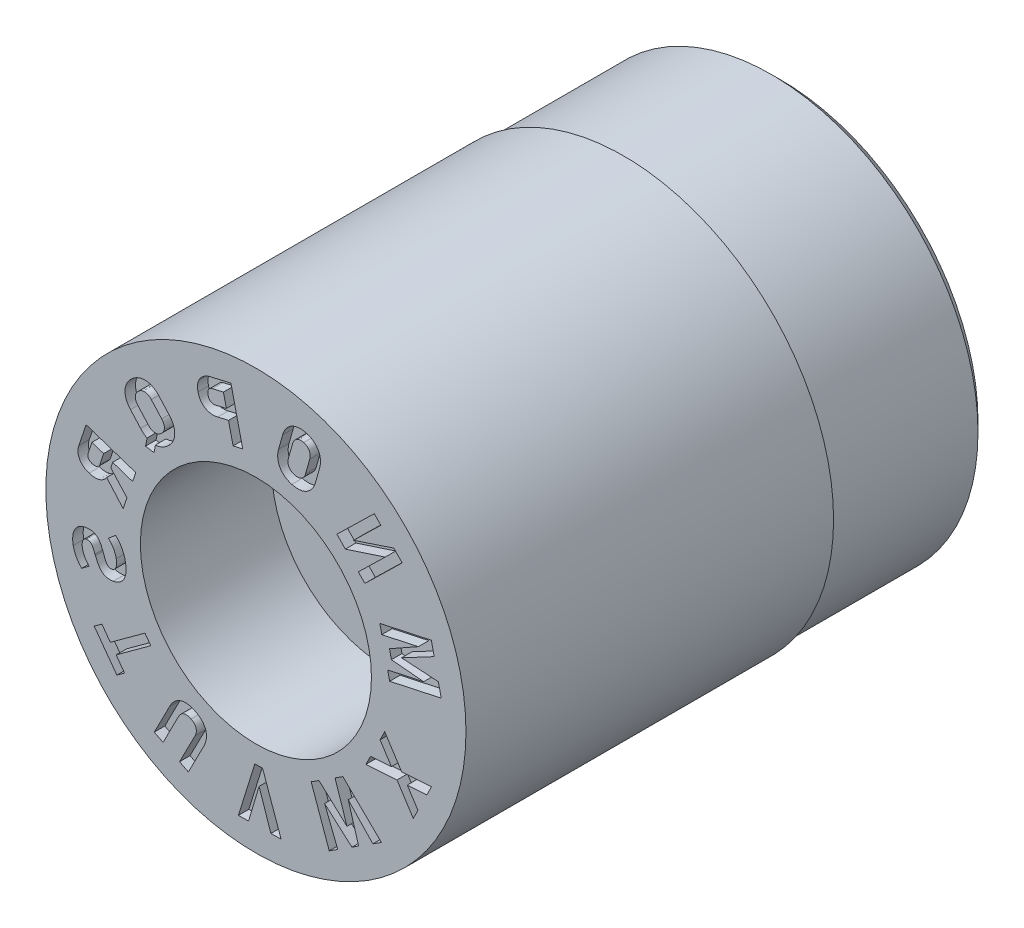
from build123d import *

# Parameters (mm, degrees)
SKETCH4_W          = 3
SKETCH4_H          = 1
CUT_EXTRUDE1_DEPTH = 0.2


with BuildPart() as part:
    # Sketch1 → Revolve1 (revolve)
    with BuildSketch(Plane(origin=(0, 0, 0), x_dir=(0, 0, -1), z_dir=(1, 0, 0)), mode=Mode.PRIVATE) as revolve1_sk:
        Polygon((0, 4), (0, 2.2), (2.5, 2.2), (2.5, 1.15), (10, 1.15), (10, 3.75), (9.75, 4), align=None)
    revolve(revolve1_sk.sketch.rotate(Axis((0, 0, 3.797909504), (0, 0, -1)), 90), axis=Axis((0, 0, 3.797909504), (0, 0, -1)))

    # Sketch4 → Cut-Revolve1 (revolve, cut)
    with BuildSketch(Plane(origin=(0, 0, 0), x_dir=(0, 0, -1), z_dir=(1, 0, 0)), mode=Mode.PRIVATE) as cut_revolve1_sk:
        with Locations((8.5, 4.435)):
            Rectangle(SKETCH4_W, SKETCH4_H)
    revolve(cut_revolve1_sk.sketch.rotate(Axis((0, 0, 0), (0, 0, -1)), 90), axis=Axis((0, 0, 0), (0, 0, -1)), mode=Mode.SUBTRACT)

    # Sketch6 → Cut-Extrude1 (cut)
    # profile 1 of 12: a face of its own
    with BuildSketch(Plane.XY):
        Polygon((3.394229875, 0.938010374), (3.341406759, 1.1816908), (2.359988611, 0.969374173), (2.396420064, 0.801280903), (3.094007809, 0.952272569), (2.544983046, 0.644005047), (2.580321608, 0.48078676), (3.194151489, 0.424211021), (2.510034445, 0.276135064), (2.546465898, 0.108041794), (3.527884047, 0.320358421), (3.475060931, 0.564038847), (2.773085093, 0.607854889), align=None)
    # profile 2 of 12: a face of its own
    with BuildSketch(Plane.XY):
        Polygon((2.786258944, 2.179442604), (2.626298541, 2.343514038), (1.858096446, 2.088459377), (2.379411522, 2.596736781), (2.254183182, 2.725230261), (1.542436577, 2.031205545), (1.703388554, 1.866088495), (2.463328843, 2.114715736), (1.949482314, 1.613702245), (2.07451234, 1.485417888), align=None)
    # profile 3 of 12: a face of its own
    with BuildSketch(Plane.XY):
        with BuildLine():
            Line((1.135151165, 2.680125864), (1.212216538, 2.95287737))
            add(Edge.make_bspline(
                [(1.212216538, 2.95287737), (1.217012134, 2.970045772), (1.222619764, 2.995856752), (1.22781073, 3.030308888), (1.229422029, 3.055403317), (1.229959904, 3.080065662), (1.228409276, 3.104301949), (1.225754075, 3.128191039), (1.221249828, 3.151530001), (1.215414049, 3.174298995), (1.207806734, 3.196273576), (1.199030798, 3.217612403), (1.188651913, 3.23800887), (1.176695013, 3.257502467), (1.163680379, 3.276358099), (1.148891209, 3.294187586), (1.132773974, 3.311167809), (1.115509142, 3.327364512), (1.09668295, 3.342074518), (1.076941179, 3.355823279), (1.056142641, 3.368666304), (1.034010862, 3.379975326), (1.002471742, 3.393629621), (0.977876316, 3.402304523), (0.960887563, 3.406983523)],
                knots=[0, 0, 0, 0, 0.091422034, 0.135457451, 0.178647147, 0.22037857, 0.261961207, 0.3031769, 0.343651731, 0.383838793, 0.423697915, 0.462886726, 0.502168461, 0.540991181, 0.58017534, 0.619643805, 0.659727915, 0.700270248, 0.741002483, 0.782210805, 0.823695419, 0.866341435, 0.909628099, 1, 1, 1, 1], degree=3))
            add(Edge.make_bspline(
                [(0.960887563, 3.406983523), (0.94387801, 3.411575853), (0.918449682, 3.417960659), (0.884319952, 3.422097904), (0.859514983, 3.42425249), (0.835085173, 3.424306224), (0.811000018, 3.423080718), (0.787315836, 3.419983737), (0.764032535, 3.415497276), (0.741436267, 3.40921077), (0.719472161, 3.401815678), (0.698471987, 3.392664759), (0.6781024, 3.382306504), (0.658593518, 3.370384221), (0.640059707, 3.356696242), (0.622033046, 3.341967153), (0.605167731, 3.325473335), (0.589057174, 3.307907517), (0.574285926, 3.288987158), (0.560272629, 3.269164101), (0.547921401, 3.247830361), (0.53630394, 3.225493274), (0.522360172, 3.193596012), (0.513937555, 3.168521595), (0.509155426, 3.151334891)],
                knots=[0, 0, 0, 0, 0.090478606, 0.133987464, 0.17621087, 0.218093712, 0.259164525, 0.299807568, 0.340490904, 0.380663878, 0.420006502, 0.459250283, 0.498027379, 0.537134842, 0.576341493, 0.616113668, 0.656419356, 0.69720995, 0.73826155, 0.779443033, 0.821603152, 0.864568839, 0.908517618, 1, 1, 1, 1], degree=3))
            Line((0.509155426, 3.151334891), (0.432090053, 2.878583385))
            add(Edge.make_bspline(
                [(0.432090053, 2.878583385), (0.427165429, 2.861481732), (0.421312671, 2.835686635), (0.416615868, 2.801258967), (0.414719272, 2.776157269), (0.414440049, 2.751527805), (0.415669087, 2.727226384), (0.418352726, 2.703322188), (0.423080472, 2.679980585), (0.428918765, 2.657227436), (0.436294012, 2.635168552), (0.445222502, 2.613979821), (0.455730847, 2.593675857), (0.467282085, 2.574030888), (0.480734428, 2.555370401), (0.495301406, 2.537293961), (0.511548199, 2.52030571), (0.528790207, 2.50408766), (0.54763701, 2.48940789), (0.56731878, 2.475558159), (0.588337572, 2.463096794), (0.610319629, 2.451380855), (0.641959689, 2.437765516), (0.66662495, 2.429123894), (0.683592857, 2.424370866)],
                knots=[0, 0, 0, 0, 0.091281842, 0.135438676, 0.17814157, 0.220333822, 0.2617021, 0.302901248, 0.343594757, 0.383765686, 0.423341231, 0.462796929, 0.50158372, 0.540551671, 0.579581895, 0.619478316, 0.659546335, 0.700072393, 0.740788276, 0.781980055, 0.82344948, 0.866054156, 0.909668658, 1, 1, 1, 1], degree=3))
            add(Edge.make_bspline(
                [(0.683592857, 2.424370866), (0.700556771, 2.419837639), (0.725924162, 2.413548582), (0.760012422, 2.409274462), (0.784837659, 2.407514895), (0.809254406, 2.407075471), (0.83330662, 2.408402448), (0.856992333, 2.411466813), (0.880267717, 2.415981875), (0.902944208, 2.422201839), (0.924795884, 2.429887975), (0.945970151, 2.438692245), (0.966077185, 2.449509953), (0.985630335, 2.461411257), (1.004343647, 2.474772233), (1.022085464, 2.489771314), (1.039194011, 2.505905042), (1.055211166, 2.523585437), (1.070104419, 2.542411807), (1.083719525, 2.562495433), (1.096532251, 2.583552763), (1.10775069, 2.606112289), (1.1217496, 2.63795565), (1.130529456, 2.66289815), (1.135151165, 2.680125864)],
                knots=[0, 0, 0, 0, 0.09019369, 0.133725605, 0.176130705, 0.217857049, 0.258949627, 0.299614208, 0.340319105, 0.380513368, 0.420146, 0.459126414, 0.498042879, 0.537171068, 0.576532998, 0.615884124, 0.656299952, 0.697112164, 0.738185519, 0.779369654, 0.821547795, 0.864563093, 0.908535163, 1, 1, 1, 1], degree=3))
        make_face()
        with BuildLine():
            Line((0.618786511, 2.820966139), (0.69837861, 3.102922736))
            add(Edge.make_bspline(
                [(0.69837861, 3.102922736), (0.70295274, 3.118755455), (0.71184631, 3.141470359), (0.72859073, 3.168595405), (0.743188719, 3.186083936), (0.759458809, 3.201171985), (0.77745389, 3.213427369), (0.796740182, 3.223153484), (0.817667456, 3.229464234), (0.839569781, 3.233362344), (0.870726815, 3.234236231), (0.89421834, 3.23011317), (0.909678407, 3.225683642)],
                knots=[0, 0, 0, 0, 0.179643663, 0.264038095, 0.346325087, 0.42716418, 0.505033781, 0.582875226, 0.661567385, 0.742348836, 0.824682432, 1, 1, 1, 1], degree=3))
            add(Edge.make_bspline(
                [(0.909678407, 3.225683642), (0.925284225, 3.221654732), (0.94719174, 3.212450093), (0.973452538, 3.195775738), (0.989979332, 3.180861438), (1.004478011, 3.16456088), (1.016047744, 3.146269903), (1.024879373, 3.126371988), (1.030778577, 3.105005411), (1.034243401, 3.08252397), (1.034120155, 3.050661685), (1.029980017, 3.026643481), (1.025452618, 3.010774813)],
                knots=[0, 0, 0, 0, 0.17523863, 0.257490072, 0.337988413, 0.417174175, 0.494693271, 0.572976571, 0.653699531, 0.735737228, 0.82022307, 1, 1, 1, 1], degree=3))
            Line((1.025452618, 3.010774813), (0.945860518, 2.728818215))
            add(Edge.make_bspline(
                [(0.945860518, 2.728818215), (0.941522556, 2.712890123), (0.932534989, 2.690117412), (0.915754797, 2.662923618), (0.901176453, 2.645408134), (0.884887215, 2.630442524), (0.866966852, 2.61818799), (0.847608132, 2.60851884), (0.826756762, 2.601927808), (0.804729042, 2.598286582), (0.773640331, 2.597596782), (0.75012233, 2.601408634), (0.734734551, 2.605950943)],
                knots=[0, 0, 0, 0, 0.179767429, 0.264883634, 0.347152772, 0.427262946, 0.50511565, 0.582940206, 0.662173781, 0.742451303, 0.825386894, 1, 1, 1, 1], degree=3))
            add(Edge.make_bspline(
                [(0.734734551, 2.605950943), (0.719181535, 2.610074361), (0.69716732, 2.619121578), (0.671035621, 2.635923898), (0.654200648, 2.65051958), (0.640016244, 2.667117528), (0.628330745, 2.685344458), (0.619621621, 2.705240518), (0.613389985, 2.72652776), (0.610292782, 2.74910651), (0.609900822, 2.781033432), (0.614372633, 2.805102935), (0.618786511, 2.820966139)],
                knots=[0, 0, 0, 0, 0.175128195, 0.257334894, 0.337663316, 0.417030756, 0.494507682, 0.572748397, 0.652926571, 0.735489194, 0.820320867, 1, 1, 1, 1], degree=3))
        make_face(mode=Mode.SUBTRACT)
    # profile 4 of 12: a face of its own
    with BuildSketch(Plane.XY):
        with BuildLine():
            Line((-0.521556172, 2.876014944), (-0.434541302, 2.49881903))
            Line((-0.434541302, 2.49881903), (-0.251282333, 2.540985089))
            Line((-0.251282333, 2.540985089), (-0.475581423, 3.513286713))
            Line((-0.475581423, 3.513286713), (-0.865487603, 3.423449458))
            add(Edge.make_bspline(
                [(-0.865487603, 3.423449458), (-0.894282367, 3.417099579), (-0.935427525, 3.40285547), (-0.984978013, 3.374907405), (-1.01721997, 3.350257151), (-1.045539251, 3.322341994), (-1.068843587, 3.290978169), (-1.087678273, 3.256900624), (-1.101088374, 3.219950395), (-1.109968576, 3.180912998), (-1.113998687, 3.125224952), (-1.108998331, 3.082829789), (-1.102272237, 3.05480594)],
                knots=[0, 0, 0, 0, 0.179264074, 0.262914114, 0.345094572, 0.425466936, 0.504017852, 0.581987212, 0.661488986, 0.742357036, 0.824785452, 1, 1, 1, 1], degree=3))
            add(Edge.make_bspline(
                [(-1.102272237, 3.05480594), (-1.095722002, 3.026757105), (-1.082085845, 2.986270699), (-1.053775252, 2.93815959), (-1.028785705, 2.907054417), (-1.000440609, 2.879961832), (-0.96869942, 2.857678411), (-0.933974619, 2.840071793), (-0.896559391, 2.827148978), (-0.856803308, 2.819560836), (-0.80011989, 2.816036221), (-0.75690198, 2.821618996), (-0.728237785, 2.828356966)],
                knots=[0, 0, 0, 0, 0.175740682, 0.257985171, 0.339043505, 0.41817568, 0.496190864, 0.574525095, 0.654741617, 0.73663625, 0.820445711, 1, 1, 1, 1], degree=3))
            Line((-0.728237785, 2.828356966), (-0.521556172, 2.876014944))
        make_face()
        with BuildLine():
            Line((-0.562266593, 3.052488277), (-0.773582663, 3.003718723))
            add(Edge.make_bspline(
                [(-0.773582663, 3.003718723), (-0.783961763, 3.001503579), (-0.799700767, 2.999431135), (-0.820400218, 3.001313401), (-0.834980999, 3.005053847), (-0.848900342, 3.010466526), (-0.86165837, 3.018251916), (-0.873608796, 3.027503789), (-0.884233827, 3.038771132), (-0.893697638, 3.051592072), (-0.904342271, 3.071228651), (-0.910045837, 3.087313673), (-0.912343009, 3.098636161)],
                knots=[0, 0, 0, 0, 0.168779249, 0.249596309, 0.32843233, 0.407061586, 0.485720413, 0.564814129, 0.646318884, 0.730711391, 0.817085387, 1, 1, 1, 1], degree=3))
            add(Edge.make_bspline(
                [(-0.912343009, 3.098636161), (-0.914930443, 3.110035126), (-0.917403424, 3.127095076), (-0.916463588, 3.149605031), (-0.91373769, 3.165364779), (-0.909305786, 3.180288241), (-0.902862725, 3.194038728), (-0.894635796, 3.20646921), (-0.884599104, 3.217465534), (-0.873178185, 3.227275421), (-0.855146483, 3.238029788), (-0.840058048, 3.243525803), (-0.829462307, 3.245812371)],
                knots=[0, 0, 0, 0, 0.184525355, 0.269846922, 0.354276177, 0.436138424, 0.514600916, 0.592865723, 0.67024582, 0.748708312, 0.829398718, 1, 1, 1, 1], degree=3))
            Line((-0.829462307, 3.245812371), (-0.618116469, 3.294588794))
            Line((-0.618116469, 3.294588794), (-0.562266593, 3.052488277))
        make_face(mode=Mode.SUBTRACT)
    # profile 5 of 12: a face of its own
    with BuildSketch(Plane.XY):
        with BuildLine():
            Line((-2.071986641, 1.810539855), (-2.100720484, 1.661978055))
            Line((-2.100720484, 1.661978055), (-1.939665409, 1.633273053))
            Line((-1.939665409, 1.633273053), (-1.912358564, 1.775217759))
            add(Edge.make_bspline(
                [(-1.912358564, 1.775217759), (-1.907225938, 1.775416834), (-1.894364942, 1.776224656), (-1.873699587, 1.778650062), (-1.850567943, 1.783350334), (-1.827508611, 1.789313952), (-1.804810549, 1.797148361), (-1.782510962, 1.806598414), (-1.760404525, 1.81743036), (-1.739050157, 1.830441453), (-1.710039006, 1.849259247), (-1.689959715, 1.866266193), (-1.67657857, 1.877858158)],
                knots=[0.553679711, 0.553679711, 0.553679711, 0.553679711, 0.579878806, 0.619385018, 0.659716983, 0.70019606, 0.740809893, 0.782074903, 0.823696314, 0.866250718, 0.90955479, 1, 1, 1, 1], degree=3))
            add(Edge.make_bspline(
                [(-1.67657857, 1.877858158), (-1.663326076, 1.889588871), (-1.644720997, 1.90818777), (-1.622400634, 1.934622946), (-1.607615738, 1.954906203), (-1.594244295, 1.975505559), (-1.58234498, 1.996687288), (-1.572207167, 2.018477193), (-1.563546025, 2.040732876), (-1.556589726, 2.063263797), (-1.551115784, 2.085868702), (-1.547604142, 2.108656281), (-1.545754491, 2.131526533), (-1.545140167, 2.154503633), (-1.546524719, 2.177560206), (-1.549849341, 2.200668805), (-1.554323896, 2.223898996), (-1.560650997, 2.246987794), (-1.568548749, 2.269813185), (-1.578255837, 2.292291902), (-1.589534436, 2.314405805), (-1.602385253, 2.336231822), (-1.621855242, 2.365281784), (-1.63880819, 2.385786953), (-1.650610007, 2.399260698)],
                knots=[0, 0, 0, 0, 0.090247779, 0.133974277, 0.176350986, 0.218190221, 0.259184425, 0.300165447, 0.340676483, 0.380906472, 0.42036049, 0.459207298, 0.498375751, 0.537338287, 0.576359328, 0.616025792, 0.656354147, 0.696955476, 0.738027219, 0.779458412, 0.821744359, 0.864571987, 0.908583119, 1, 1, 1, 1], degree=3))
            Line((-1.650610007, 2.399260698), (-1.840940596, 2.611640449))
            add(Edge.make_bspline(
                [(-1.840940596, 2.611640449), (-1.852707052, 2.625214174), (-1.871795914, 2.643697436), (-1.898257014, 2.666562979), (-1.918716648, 2.681490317), (-1.939482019, 2.695104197), (-1.960799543, 2.707172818), (-1.982609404, 2.717565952), (-2.004845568, 2.726424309), (-2.027353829, 2.733581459), (-2.049999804, 2.739283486), (-2.072836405, 2.742970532), (-2.095754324, 2.745121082), (-2.118725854, 2.745616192), (-2.141732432, 2.744417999), (-2.164821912, 2.741714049), (-2.187915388, 2.7370011), (-2.210857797, 2.730759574), (-2.233595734, 2.722987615), (-2.255909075, 2.71354897), (-2.277954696, 2.702591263), (-2.299645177, 2.690030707), (-2.328414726, 2.67072812), (-2.348711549, 2.653980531), (-2.362029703, 2.642290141)],
                knots=[0, 0, 0, 0, 0.091500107, 0.135420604, 0.17827148, 0.220576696, 0.262026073, 0.303120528, 0.343722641, 0.384020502, 0.423519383, 0.462729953, 0.501891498, 0.540854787, 0.579819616, 0.619323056, 0.659321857, 0.69992397, 0.740534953, 0.781797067, 0.823415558, 0.86603746, 0.909561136, 1, 1, 1, 1], degree=3))
            add(Edge.make_bspline(
                [(-2.362029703, 2.642290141), (-2.374943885, 2.630237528), (-2.394074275, 2.612166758), (-2.415950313, 2.585365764), (-2.43096626, 2.565346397), (-2.444447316, 2.544761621), (-2.45615494, 2.523548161), (-2.466433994, 2.501828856), (-2.475026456, 2.47961312), (-2.48201747, 2.457091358), (-2.487400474, 2.434466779), (-2.491239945, 2.411731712), (-2.493082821, 2.388839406), (-2.49340028, 2.365849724), (-2.491993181, 2.34282), (-2.489069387, 2.319644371), (-2.484178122, 2.296488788), (-2.477959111, 2.273358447), (-2.470030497, 2.250538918), (-2.460331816, 2.228058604), (-2.449050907, 2.20594514), (-2.436200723, 2.184119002), (-2.4167305, 2.155069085), (-2.399777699, 2.134563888), (-2.387975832, 2.121090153)],
                knots=[0, 0, 0, 0, 0.090258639, 0.133806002, 0.176368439, 0.217909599, 0.259234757, 0.299899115, 0.340421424, 0.380662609, 0.420127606, 0.459002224, 0.498181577, 0.537187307, 0.576219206, 0.61581336, 0.656258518, 0.696871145, 0.737954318, 0.77939704, 0.821694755, 0.8645343, 0.90855768, 1, 1, 1, 1], degree=3))
            Line((-2.387975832, 2.121090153), (-2.197645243, 1.908710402))
            add(Edge.make_bspline(
                [(-2.197645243, 1.908710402), (-2.185860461, 1.895162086), (-2.166825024, 1.876604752), (-2.140252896, 1.853834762), (-2.120019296, 1.83858704), (-2.099032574, 1.825298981), (-2.08297394, 1.816119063), (-2.073864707, 1.811475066), (-2.071986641, 1.810539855)],
                knots=[0, 0, 0, 0, 0.091506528, 0.135430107, 0.17845877, 0.220611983, 0.262064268, 0.272765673, 0.272765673, 0.272765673, 0.272765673], degree=3))
        make_face()
        with BuildLine():
            Line((-2.047987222, 2.036275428), (-2.24471167, 2.255719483))
            add(Edge.make_bspline(
                [(-2.24471167, 2.255719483), (-2.255887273, 2.268032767), (-2.270325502, 2.287899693), (-2.284502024, 2.316693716), (-2.291497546, 2.338429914), (-2.295502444, 2.360314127), (-2.296472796, 2.382159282), (-2.29404297, 2.403878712), (-2.288329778, 2.425183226), (-2.279702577, 2.445855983), (-2.263567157, 2.472600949), (-2.247688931, 2.490446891), (-2.235570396, 2.50116109)],
                knots=[0, 0, 0, 0, 0.180084, 0.264435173, 0.34680363, 0.426690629, 0.504877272, 0.582907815, 0.66255024, 0.743142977, 0.824840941, 1, 1, 1, 1], degree=3))
            add(Edge.make_bspline(
                [(-2.235570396, 2.50116109), (-2.223506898, 2.511841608), (-2.204248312, 2.526122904), (-2.175739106, 2.538982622), (-2.154309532, 2.545566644), (-2.132511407, 2.548631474), (-2.110685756, 2.548813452), (-2.089015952, 2.545489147), (-2.067659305, 2.53917415), (-2.046799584, 2.529943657), (-2.01988148, 2.512529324), (-2.001312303, 2.496504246), (-1.990418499, 2.483850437)],
                knots=[0, 0, 0, 0, 0.174919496, 0.257091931, 0.337884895, 0.416966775, 0.494750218, 0.573557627, 0.653541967, 0.735473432, 0.819741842, 1, 1, 1, 1], degree=3))
            Line((-1.990418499, 2.483850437), (-1.793694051, 2.264406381))
            add(Edge.make_bspline(
                [(-1.793694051, 2.264406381), (-1.782405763, 2.252214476), (-1.768320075, 2.232174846), (-1.754096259, 2.203460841), (-1.747113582, 2.181716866), (-1.74310405, 2.159834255), (-1.742139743, 2.137990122), (-1.744542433, 2.116332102), (-1.750296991, 2.095111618), (-1.758889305, 2.074394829), (-1.775276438, 2.047693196), (-1.791072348, 2.029694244), (-1.803240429, 2.019009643)],
                knots=[0, 0, 0, 0, 0.179661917, 0.264031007, 0.346416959, 0.426320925, 0.504524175, 0.582571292, 0.661502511, 0.742112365, 0.824803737, 1, 1, 1, 1], degree=3))
            add(Edge.make_bspline(
                [(-1.803240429, 2.019009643), (-1.815274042, 2.008248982), (-1.834570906, 1.994232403), (-1.862861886, 1.981036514), (-1.884353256, 1.974921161), (-1.906062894, 1.971430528), (-1.927859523, 1.97135328), (-1.949453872, 1.974647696), (-1.970809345, 1.980978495), (-1.991694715, 1.990201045), (-2.018887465, 2.007235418), (-2.037056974, 2.023737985), (-2.047987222, 2.036275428)],
                knots=[0, 0, 0, 0, 0.175140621, 0.256784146, 0.337393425, 0.416763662, 0.494645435, 0.572816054, 0.652901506, 0.735638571, 0.819694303, 1, 1, 1, 1], degree=3))
        make_face(mode=Mode.SUBTRACT)
    # profile 6 of 12: a face of its own
    with BuildSketch(Plane.XY):
        with BuildLine():
            Line((-2.727747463, 1.082066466), (-2.347620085, 0.954385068))
            Line((-2.347620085, 0.954385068), (-2.287716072, 1.132229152))
            Line((-2.287716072, 1.132229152), (-3.233089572, 1.449771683))
            Line((-3.233089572, 1.449771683), (-3.372112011, 1.036020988))
            add(Edge.make_bspline(
                [(-3.372112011, 1.036020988), (-3.380594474, 1.011415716), (-3.38851292, 0.973635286), (-3.389249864, 0.92312386), (-3.384029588, 0.88707868), (-3.374062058, 0.852562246), (-3.359348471, 0.819817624), (-3.339479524, 0.789509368), (-3.315250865, 0.76136871), (-3.286644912, 0.735941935), (-3.242020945, 0.70529004), (-3.203802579, 0.688881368), (-3.177225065, 0.679835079)],
                knots=[0, 0, 0, 0, 0.170636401, 0.251235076, 0.330355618, 0.408725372, 0.48632043, 0.565006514, 0.645708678, 0.729338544, 0.815468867, 1, 1, 1, 1], degree=3))
            add(Edge.make_bspline(
                [(-3.177225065, 0.679835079), (-3.15063298, 0.670802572), (-3.110283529, 0.661238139), (-3.056309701, 0.658744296), (-3.018162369, 0.661767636), (-2.981772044, 0.669423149), (-2.947658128, 0.681873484), (-2.916147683, 0.69902197), (-2.887213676, 0.720461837), (-2.862169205, 0.745813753), (-2.847716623, 0.764534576), (-2.841354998, 0.774125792)],
                knots=[0, 0, 0, 0, 0.184576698, 0.270218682, 0.353956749, 0.435258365, 0.51372416, 0.591599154, 0.670106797, 0.749358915, 0.824936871, 0.824936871, 0.824936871, 0.824936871], degree=3))
            Line((-2.841354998, 0.774125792), (-2.527919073, 0.417717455))
            Line((-2.527919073, 0.417717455), (-2.455468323, 0.633360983))
            Line((-2.455468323, 0.633360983), (-2.764024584, 0.973957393))
            Line((-2.764024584, 0.973957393), (-2.727747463, 1.082066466))
        make_face()
        with BuildLine():
            Line((-2.899191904, 1.139653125), (-2.973617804, 0.918027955))
            add(Edge.make_bspline(
                [(-2.973617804, 0.918027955), (-2.976433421, 0.909309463), (-2.982308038, 0.897027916), (-2.993525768, 0.883110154), (-3.003267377, 0.874388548), (-3.014179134, 0.867113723), (-3.02613619, 0.861172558), (-3.039317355, 0.857499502), (-3.053405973, 0.855332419), (-3.068204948, 0.85450718), (-3.089264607, 0.856256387), (-3.105119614, 0.859460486), (-3.115581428, 0.863009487)],
                knots=[0, 0, 0, 0, 0.161067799, 0.236329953, 0.312906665, 0.389938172, 0.466300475, 0.546541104, 0.629300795, 0.716596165, 0.806347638, 1, 1, 1, 1], degree=3))
            add(Edge.make_bspline(
                [(-3.115581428, 0.863009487), (-3.125957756, 0.866695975), (-3.141129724, 0.872686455), (-3.158745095, 0.884432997), (-3.170238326, 0.893825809), (-3.180121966, 0.904124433), (-3.188364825, 0.91508677), (-3.194337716, 0.927051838), (-3.198725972, 0.939446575), (-3.201096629, 0.952377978), (-3.20149903, 0.970436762), (-3.198856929, 0.984010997), (-3.195689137, 0.992794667)],
                knots=[0, 0, 0, 0, 0.193238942, 0.282530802, 0.369322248, 0.452323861, 0.531630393, 0.608138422, 0.685234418, 0.760907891, 0.836971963, 1, 1, 1, 1], degree=3))
            Line((-3.195689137, 0.992794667), (-3.121316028, 1.214262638))
            Line((-3.121316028, 1.214262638), (-2.899191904, 1.139653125))
        make_face(mode=Mode.SUBTRACT)
    # profile 7 of 12: a face of its own
    with BuildSketch(Plane.XY):
        Polygon((-2.772222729, -1.908933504), (-2.932572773, -1.689104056), (-3.07914003, -1.795961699), (-2.64777514, -2.387334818), (-2.501207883, -2.280477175), (-2.661366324, -2.060910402), (-2.001367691, -1.579308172), (-2.112291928, -1.427380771), align=None)
    # profile 8 of 12: a face of its own
    with BuildSketch(Plane.XY):
        with BuildLine():
            Line((-2.6724965, -0.096605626), (-2.809288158, -0.210099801))
            add(Edge.make_bspline(
                [(-2.809288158, -0.210099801), (-2.790163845, -0.226236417), (-2.763771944, -0.253499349), (-2.733519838, -0.294451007), (-2.713113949, -0.327854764), (-2.695206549, -0.363041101), (-2.675246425, -0.41185217), (-2.664939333, -0.450050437), (-2.660202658, -0.47593053)],
                knots=[0, 0, 0, 0, 0.241531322, 0.364928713, 0.491180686, 0.619227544, 0.745917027, 1, 1, 1, 1], degree=3))
            add(Edge.make_bspline(
                [(-2.660202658, -0.47593053), (-2.657676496, -0.490197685), (-2.654434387, -0.511156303), (-2.653277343, -0.538515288), (-2.652900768, -0.55732623), (-2.654385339, -0.575039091), (-2.656682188, -0.591750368), (-2.660427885, -0.607326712), (-2.665111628, -0.621815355), (-2.671047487, -0.635043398), (-2.678067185, -0.646910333), (-2.686282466, -0.657349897), (-2.695582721, -0.666312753), (-2.705827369, -0.674016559), (-2.72141978, -0.682210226), (-2.734257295, -0.686097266), (-2.743163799, -0.687800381)],
                knots=[0, 0, 0, 0, 0.170861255, 0.249053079, 0.322477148, 0.39228025, 0.458186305, 0.520993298, 0.58072803, 0.637308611, 0.691419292, 0.742742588, 0.793280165, 0.843180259, 0.893202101, 1, 1, 1, 1], degree=3))
            add(Edge.make_bspline(
                [(-2.743163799, -0.687800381), (-2.755656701, -0.69032988), (-2.773492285, -0.690793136), (-2.795847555, -0.684989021), (-2.810324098, -0.677317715), (-2.823386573, -0.667250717), (-2.834874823, -0.654877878), (-2.845578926, -0.64085901), (-2.854887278, -0.624528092), (-2.863428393, -0.605968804), (-2.876064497, -0.576759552), (-2.884910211, -0.553278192), (-2.890647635, -0.53664473)],
                knots=[0, 0, 0, 0, 0.155371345, 0.225428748, 0.294697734, 0.36450425, 0.436526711, 0.511150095, 0.590840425, 0.67758894, 0.77376221, 1, 1, 1, 1], degree=3))
            add(Edge.make_bspline(
                [(-2.890647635, -0.53664473), (-2.891245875, -0.535579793), (-2.892358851, -0.533281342), (-2.892664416, -0.530743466), (-2.893318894, -0.529593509)],
                knots=[0, 0, 0, 0, 0.486526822, 1, 1, 1, 1], degree=3))
            Line((-2.893318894, -0.529593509), (-2.898161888, -0.515083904))
            add(Edge.make_bspline(
                [(-2.898161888, -0.515083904), (-2.908584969, -0.485779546), (-2.924291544, -0.443816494), (-2.948407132, -0.392140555), (-2.965842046, -0.358982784), (-2.985668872, -0.329597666), (-3.009219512, -0.303698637), (-3.037279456, -0.281689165), (-3.063157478, -0.265676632), (-3.086001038, -0.255273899), (-3.104645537, -0.249193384), (-3.124484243, -0.244683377), (-3.145653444, -0.242027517), (-3.16810451, -0.241213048), (-3.200612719, -0.242252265), (-3.225530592, -0.245254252), (-3.242383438, -0.248429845)],
                knots=[0, 0, 0, 0, 0.19060579, 0.274057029, 0.349203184, 0.419846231, 0.490621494, 0.562623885, 0.63761783, 0.676454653, 0.716094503, 0.757523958, 0.800894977, 0.846569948, 0.894993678, 1, 1, 1, 1], degree=3))
            add(Edge.make_bspline(
                [(-3.242383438, -0.248429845), (-3.258514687, -0.251250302), (-3.280779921, -0.257151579), (-3.309569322, -0.266488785), (-3.329423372, -0.275358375), (-3.348406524, -0.284737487), (-3.36609455, -0.295683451), (-3.382765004, -0.307646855), (-3.398299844, -0.32071403), (-3.41271473, -0.334914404), (-3.425713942, -0.350359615), (-3.437689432, -0.366600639), (-3.448340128, -0.383953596), (-3.457842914, -0.402226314), (-3.46608944, -0.421602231), (-3.47296321, -0.441988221), (-3.478848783, -0.46337311), (-3.483340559, -0.485717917), (-3.486690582, -0.508901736), (-3.488379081, -0.532922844), (-3.488972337, -0.557803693), (-3.488450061, -0.58359373), (-3.485486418, -0.619721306), (-3.481910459, -0.647168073), (-3.478357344, -0.665583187)],
                knots=[0, 0, 0, 0, 0.08589598, 0.127211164, 0.167041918, 0.205922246, 0.244128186, 0.28182182, 0.319215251, 0.356182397, 0.393477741, 0.430644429, 0.467581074, 0.505858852, 0.544351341, 0.583807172, 0.624649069, 0.666823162, 0.709660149, 0.753990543, 0.79978411, 0.847150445, 0.896440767, 1, 1, 1, 1], degree=3))
            add(Edge.make_bspline(
                [(-3.478357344, -0.665583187), (-3.475031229, -0.683347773), (-3.46875666, -0.710009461), (-3.456806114, -0.744798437), (-3.443266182, -0.780150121), (-3.422344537, -0.823307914), (-3.382464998, -0.889551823), (-3.345412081, -0.934644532), (-3.318219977, -0.962312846)],
                knots=[0, 0, 0, 0, 0.158617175, 0.239721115, 0.322560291, 0.490631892, 0.659656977, 1, 1, 1, 1], degree=3))
            Line((-3.318219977, -0.962312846), (-3.175681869, -0.855358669))
            add(Edge.make_bspline(
                [(-3.175681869, -0.855358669), (-3.191973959, -0.839202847), (-3.214363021, -0.813296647), (-3.241027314, -0.776609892), (-3.258411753, -0.748287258), (-3.273505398, -0.719644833), (-3.289580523, -0.681934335), (-3.297721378, -0.652799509), (-3.30138811, -0.633408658)],
                knots=[0, 0, 0, 0, 0.265785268, 0.396258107, 0.525376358, 0.650699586, 0.771281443, 1, 1, 1, 1], degree=3))
            add(Edge.make_bspline(
                [(-3.30138811, -0.633408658), (-3.303841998, -0.620027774), (-3.306480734, -0.600342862), (-3.308336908, -0.574646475), (-3.308158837, -0.556988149), (-3.307353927, -0.540342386), (-3.305198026, -0.524752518), (-3.302018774, -0.510175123), (-3.297728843, -0.496708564), (-3.292409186, -0.484424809), (-3.285991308, -0.473369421), (-3.278705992, -0.463589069), (-3.270207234, -0.455286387), (-3.260946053, -0.448243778), (-3.246912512, -0.440626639), (-3.235412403, -0.436770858), (-3.227276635, -0.435569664)],
                knots=[0, 0, 0, 0, 0.17279968, 0.252260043, 0.327128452, 0.397072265, 0.46389959, 0.526868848, 0.586457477, 0.643228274, 0.696616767, 0.748590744, 0.797674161, 0.847120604, 0.895952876, 1, 1, 1, 1], degree=3))
            add(Edge.make_bspline(
                [(-3.227276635, -0.435569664), (-3.213760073, -0.432926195), (-3.194370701, -0.432199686), (-3.170134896, -0.438556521), (-3.154640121, -0.447079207), (-3.140865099, -0.4579986), (-3.128336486, -0.470689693), (-3.11723534, -0.485079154), (-3.107282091, -0.501571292), (-3.097847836, -0.520750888), (-3.082902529, -0.552540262), (-3.072423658, -0.57870138), (-3.065112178, -0.597290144)],
                knots=[0, 0, 0, 0, 0.156930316, 0.226988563, 0.29577913, 0.365837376, 0.435731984, 0.507633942, 0.58172312, 0.664710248, 0.762051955, 1, 1, 1, 1], degree=3))
            add(Edge.make_bspline(
                [(-3.065112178, -0.597290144), (-3.064048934, -0.598849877), (-3.063411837, -0.602517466), (-3.061785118, -0.605838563), (-3.061213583, -0.607581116)],
                knots=[0, 0, 0, 0, 0.500684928, 1, 1, 1, 1], degree=3))
            add(Edge.make_bspline(
                [(-3.061213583, -0.607581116), (-3.060283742, -0.610132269), (-3.058390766, -0.615183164), (-3.055584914, -0.619803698), (-3.054938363, -0.622419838)],
                knots=[0, 0, 0, 0, 0.505821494, 1, 1, 1, 1], degree=3))
            add(Edge.make_bspline(
                [(-3.054938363, -0.622419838), (-3.043979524, -0.650113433), (-3.027135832, -0.689680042), (-3.001662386, -0.73836625), (-2.983373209, -0.769967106), (-2.962498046, -0.797741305), (-2.938445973, -0.822029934), (-2.91064683, -0.842723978), (-2.884964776, -0.857081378), (-2.862691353, -0.866624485), (-2.844604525, -0.872235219), (-2.825405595, -0.875997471), (-2.805195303, -0.878450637), (-2.783942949, -0.879238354), (-2.753352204, -0.878523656), (-2.730040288, -0.87511641), (-2.714231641, -0.872317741)],
                knots=[0, 0, 0, 0, 0.1897597, 0.273414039, 0.349872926, 0.422014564, 0.494051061, 0.566780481, 0.642000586, 0.68086062, 0.720927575, 0.762335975, 0.80529276, 0.850452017, 0.897653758, 1, 1, 1, 1], degree=3))
            Line((-2.714231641, -0.872317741), (-2.71282543, -0.872002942))
            add(Edge.make_bspline(
                [(-2.71282543, -0.872002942), (-2.697789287, -0.869068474), (-2.675631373, -0.863960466), (-2.647559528, -0.853843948), (-2.627859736, -0.845313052), (-2.609195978, -0.835689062), (-2.591703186, -0.824700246), (-2.575417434, -0.812370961), (-2.560177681, -0.798951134), (-2.545954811, -0.784415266), (-2.533090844, -0.768666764), (-2.521415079, -0.751890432), (-2.510801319, -0.734175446), (-2.501732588, -0.715109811), (-2.493614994, -0.695158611), (-2.486885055, -0.674061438), (-2.481404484, -0.652002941), (-2.477001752, -0.628995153), (-2.47406298, -0.605062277), (-2.472415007, -0.580253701), (-2.471846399, -0.554554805), (-2.472837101, -0.528033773), (-2.475550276, -0.490803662), (-2.479986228, -0.462619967), (-2.483305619, -0.443565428)],
                knots=[0, 0, 0, 0, 0.083566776, 0.123558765, 0.16247725, 0.20050143, 0.237894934, 0.274918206, 0.311707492, 0.348478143, 0.385628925, 0.422392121, 0.459802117, 0.498038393, 0.537338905, 0.577119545, 0.618612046, 0.661154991, 0.704712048, 0.749938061, 0.796619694, 0.844739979, 0.894529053, 1, 1, 1, 1], degree=3))
            add(Edge.make_bspline(
                [(-2.483305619, -0.443565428), (-2.487547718, -0.42037344), (-2.495651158, -0.385988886), (-2.509953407, -0.34131), (-2.522284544, -0.308737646), (-2.53618008, -0.277190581), (-2.551610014, -0.24680358), (-2.568505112, -0.217693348), (-2.586811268, -0.189975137), (-2.606512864, -0.163911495), (-2.633919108, -0.131681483), (-2.656484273, -0.109755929), (-2.6724965, -0.096605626)],
                knots=[0, 0, 0, 0, 0.175524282, 0.262635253, 0.349121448, 0.434717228, 0.519166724, 0.602730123, 0.685182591, 0.766327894, 0.845836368, 1, 1, 1, 1], degree=3))
        make_face()
    # profile 9 of 12: a face of its own
    with BuildSketch(Plane.XY):
        with BuildLine():
            Line((-1.644051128, -2.404096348), (-1.935295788, -2.971539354))
            Line((-1.935295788, -2.971539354), (-1.767789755, -3.057557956))
            Line((-1.767789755, -3.057557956), (-1.474373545, -2.485799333))
            add(Edge.make_bspline(
                [(-1.474373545, -2.485799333), (-1.468061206, -2.473847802), (-1.45831047, -2.456437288), (-1.442002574, -2.436332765), (-1.429713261, -2.423105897), (-1.416576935, -2.411665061), (-1.402796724, -2.401876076), (-1.387969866, -2.394237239), (-1.372700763, -2.387890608), (-1.356746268, -2.383564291), (-1.34042269, -2.380893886), (-1.32368814, -2.38027909), (-1.306590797, -2.381763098), (-1.289120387, -2.38469269), (-1.264823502, -2.391700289), (-1.246966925, -2.399256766), (-1.235179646, -2.405309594)],
                knots=[0, 0, 0, 0, 0.141623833, 0.207266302, 0.270211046, 0.330127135, 0.389067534, 0.446407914, 0.504103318, 0.561614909, 0.618774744, 0.676675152, 0.736135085, 0.797895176, 0.861548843, 1, 1, 1, 1], degree=3))
            add(Edge.make_bspline(
                [(-1.235179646, -2.405309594), (-1.223125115, -2.411132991), (-1.206714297, -2.42172644), (-1.186546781, -2.437272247), (-1.173867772, -2.449822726), (-1.162799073, -2.463053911), (-1.153487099, -2.477070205), (-1.145927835, -2.491836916), (-1.14009295, -2.507282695), (-1.136215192, -2.523358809), (-1.133869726, -2.539856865), (-1.133599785, -2.55682596), (-1.135402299, -2.574157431), (-1.138724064, -2.591893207), (-1.145954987, -2.616749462), (-1.153767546, -2.635062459), (-1.160086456, -2.647119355)],
                knots=[0, 0, 0, 0, 0.13909924, 0.203175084, 0.264969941, 0.324581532, 0.382664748, 0.439926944, 0.497105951, 0.554284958, 0.611913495, 0.670426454, 0.730623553, 0.793207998, 0.858211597, 1, 1, 1, 1], degree=3))
            Line((-1.160086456, -2.647119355), (-1.453502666, -3.218877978))
            Line((-1.453502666, -3.218877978), (-1.28583102, -3.304777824))
            Line((-1.28583102, -3.304777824), (-0.994586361, -2.737334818))
            add(Edge.make_bspline(
                [(-0.994586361, -2.737334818), (-0.98606665, -2.720458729), (-0.974464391, -2.695108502), (-0.961673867, -2.660769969), (-0.954322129, -2.635668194), (-0.948190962, -2.610997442), (-0.944086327, -2.586687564), (-0.941579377, -2.562707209), (-0.940723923, -2.53907553), (-0.941578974, -2.515802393), (-0.944027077, -2.49305025), (-0.948443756, -2.470941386), (-0.953940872, -2.449291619), (-0.961592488, -2.428290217), (-0.970681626, -2.407758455), (-0.981794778, -2.387938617), (-0.994160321, -2.368503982), (-1.008118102, -2.349670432), (-1.023860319, -2.331728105), (-1.041067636, -2.314426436), (-1.059756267, -2.297716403), (-1.080167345, -2.28200032), (-1.109838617, -2.261647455), (-1.133547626, -2.247845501), (-1.150176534, -2.239534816)],
                knots=[0, 0, 0, 0, 0.095616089, 0.140883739, 0.185213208, 0.227848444, 0.269395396, 0.309799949, 0.349729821, 0.388896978, 0.427510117, 0.465330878, 0.502852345, 0.540373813, 0.578244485, 0.616303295, 0.655184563, 0.694704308, 0.734740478, 0.775807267, 0.818069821, 0.861446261, 0.906008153, 1, 1, 1, 1], degree=3))
            add(Edge.make_bspline(
                [(-1.150176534, -2.239534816), (-1.166781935, -2.231150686), (-1.191736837, -2.219775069), (-1.225477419, -2.207261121), (-1.250146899, -2.200204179), (-1.274457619, -2.194747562), (-1.298379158, -2.190687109), (-1.322090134, -2.188594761), (-1.345479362, -2.188065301), (-1.368434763, -2.189192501), (-1.390914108, -2.192185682), (-1.412821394, -2.19663796), (-1.434269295, -2.20286509), (-1.45507517, -2.210831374), (-1.475458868, -2.220388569), (-1.495314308, -2.231630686), (-1.514638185, -2.244530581), (-1.533414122, -2.258916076), (-1.551271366, -2.275118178), (-1.568517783, -2.292759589), (-1.585118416, -2.311986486), (-1.601070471, -2.332708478), (-1.621775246, -2.362913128), (-1.635429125, -2.38727002), (-1.644051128, -2.404096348)],
                knots=[0, 0, 0, 0, 0.094224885, 0.138798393, 0.182169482, 0.224092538, 0.264971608, 0.304984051, 0.34455756, 0.383407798, 0.421281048, 0.459330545, 0.49655254, 0.534280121, 0.572076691, 0.610496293, 0.649749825, 0.689691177, 0.730200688, 0.771783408, 0.814600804, 0.858800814, 0.904194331, 1, 1, 1, 1], degree=3))
        make_face()
    # profile 10 of 12: a face of its own
    with BuildSketch(Plane.XY):
        Polygon((-0.333825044, -3.544311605), (-0.139819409, -3.540491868), (0.059624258, -2.869366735), (0.285081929, -3.532243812), (0.479087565, -3.528424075), (0.126861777, -2.53495644), (-0.02047913, -2.537790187), align=None)
    # profile 11 of 12: a face of its own
    with BuildSketch(Plane.XY):
        Polygon((1.828959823, -2.986745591), (1.956407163, -2.905351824), (1.758204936, -2.240041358), (2.226054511, -2.732995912), (2.389543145, -2.628527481), (1.656490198, -1.909882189), (1.506956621, -2.005536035), (1.733910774, -2.689754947), (1.200997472, -2.201066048), (1.051463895, -2.296719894), (1.396008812, -3.263655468), (1.559497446, -3.159187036), (1.308436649, -2.52758562), align=None)
    # profile 12 of 12: a face of its own
    with BuildSketch(Plane.XY):
        Polygon((2.686751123, -1.448713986), (2.996604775, -1.929018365), (3.085671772, -1.750503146), (2.882390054, -1.435627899), (3.255276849, -1.410606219), (3.344343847, -1.232091), (2.775297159, -1.27016797), (2.453165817, -0.770654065), (2.363976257, -0.949006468), (2.580059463, -1.283226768), (2.184014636, -1.309708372), (2.094947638, -1.48822359), align=None)
    extrude(amount=-CUT_EXTRUDE1_DEPTH, mode=Mode.SUBTRACT)


solid = part.part
